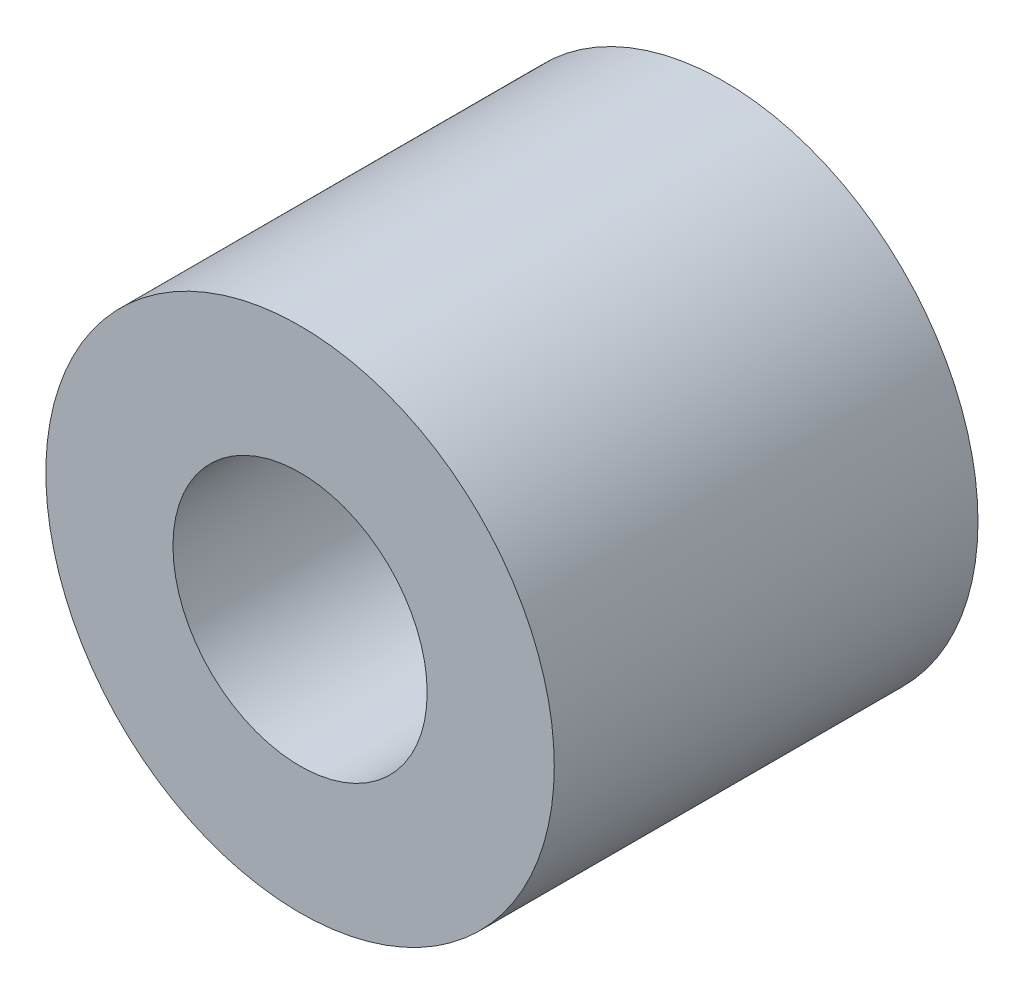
ISO-10303-21;
HEADER;
FILE_DESCRIPTION(('STEP AP214'),'2;1');
FILE_NAME('part.step','',(''),(''),'','','');
FILE_SCHEMA(('AUTOMOTIVE_DESIGN { 1 0 10303 214 1 1 1 1 }'));
ENDSEC;
DATA;
#1=APPLICATION_CONTEXT('core data for automotive mechanical design processes');
#2=APPLICATION_PROTOCOL_DEFINITION('international standard','automotive_design',2000,#1);
#3=PRODUCT_CONTEXT('',#1,'mechanical');
#4=PRODUCT('Part','Part','',(#3));
#5=PRODUCT_RELATED_PRODUCT_CATEGORY('part','',(#4));
#6=PRODUCT_DEFINITION_FORMATION('','',#4);
#7=PRODUCT_DEFINITION_CONTEXT('part definition',#1,'design');
#8=PRODUCT_DEFINITION('design','',#6,#7);
#9=PRODUCT_DEFINITION_SHAPE('','',#8);
#10=(LENGTH_UNIT() NAMED_UNIT(*) SI_UNIT(.MILLI.,.METRE.));
#11=(NAMED_UNIT(*) PLANE_ANGLE_UNIT() SI_UNIT($,.RADIAN.));
#12=(NAMED_UNIT(*) SI_UNIT($,.STERADIAN.) SOLID_ANGLE_UNIT());
#13=UNCERTAINTY_MEASURE_WITH_UNIT(LENGTH_MEASURE(1.E-05),#10,'distance_accuracy_value','');
#14=(GEOMETRIC_REPRESENTATION_CONTEXT(3) GLOBAL_UNCERTAINTY_ASSIGNED_CONTEXT((#13)) GLOBAL_UNIT_ASSIGNED_CONTEXT((#10,
#11,#12)) REPRESENTATION_CONTEXT('',''));
#15=CARTESIAN_POINT('',(0.,0.,0.));
#16=DIRECTION('',(0.,0.,1.));
#17=DIRECTION('',(1.,0.,0.));
#18=AXIS2_PLACEMENT_3D('',#15,#16,#17);
#19=CARTESIAN_POINT('',(0.,0.,0.));
#20=DIRECTION('',(0.,0.,1.));
#21=DIRECTION('',(1.,0.,0.));
#22=AXIS2_PLACEMENT_3D('',#19,#20,#21);
#23=CYLINDRICAL_SURFACE('',#22,3.);
#24=CARTESIAN_POINT('',(0.,0.,0.));
#25=DIRECTION('',(0.,0.,1.));
#26=DIRECTION('',(1.,0.,0.));
#27=AXIS2_PLACEMENT_3D('',#24,#25,#26);
#28=CIRCLE('',#27,3.);
#29=CARTESIAN_POINT('',(3.,0.,0.));
#30=VERTEX_POINT('',#29);
#31=EDGE_CURVE('E26',#30,#30,#28,.T.);
#32=ORIENTED_EDGE('',*,*,#31,.F.);
#33=EDGE_LOOP('',(#32));
#34=FACE_BOUND('',#33,.T.);
#35=CARTESIAN_POINT('',(0.,0.,10.));
#36=DIRECTION('',(0.,0.,1.));
#37=DIRECTION('',(1.,0.,0.));
#38=AXIS2_PLACEMENT_3D('',#35,#36,#37);
#39=CIRCLE('',#38,3.);
#40=CARTESIAN_POINT('',(3.,0.,10.));
#41=VERTEX_POINT('',#40);
#42=EDGE_CURVE('E17',#41,#41,#39,.T.);
#43=ORIENTED_EDGE('',*,*,#42,.T.);
#44=EDGE_LOOP('',(#43));
#45=FACE_BOUND('',#44,.T.);
#46=ADVANCED_FACE('F14',(#34,#45),#23,.F.);
#47=CARTESIAN_POINT('',(0.,0.,10.));
#48=DIRECTION('',(0.,0.,-1.));
#49=DIRECTION('',(-1.,0.,0.));
#50=AXIS2_PLACEMENT_3D('',#47,#48,#49);
#51=PLANE('',#50);
#52=ORIENTED_EDGE('',*,*,#42,.F.);
#53=EDGE_LOOP('',(#52));
#54=FACE_BOUND('',#53,.T.);
#55=CARTESIAN_POINT('',(0.,0.,10.));
#56=DIRECTION('',(0.,0.,1.));
#57=DIRECTION('',(1.,0.,0.));
#58=AXIS2_PLACEMENT_3D('',#55,#56,#57);
#59=CIRCLE('',#58,6.);
#60=CARTESIAN_POINT('',(6.,0.,10.));
#61=VERTEX_POINT('',#60);
#62=EDGE_CURVE('E21',#61,#61,#59,.F.);
#63=ORIENTED_EDGE('',*,*,#62,.F.);
#64=EDGE_LOOP('',(#63));
#65=FACE_BOUND('',#64,.T.);
#66=ADVANCED_FACE('F35',(#54,#65),#51,.F.);
#67=CARTESIAN_POINT('',(0.,0.,0.));
#68=DIRECTION('',(0.,0.,-1.));
#69=DIRECTION('',(-1.,0.,0.));
#70=AXIS2_PLACEMENT_3D('',#67,#68,#69);
#71=PLANE('',#70);
#72=ORIENTED_EDGE('',*,*,#31,.T.);
#73=EDGE_LOOP('',(#72));
#74=FACE_BOUND('',#73,.T.);
#75=CARTESIAN_POINT('',(0.,0.,0.));
#76=DIRECTION('',(0.,0.,1.));
#77=DIRECTION('',(1.,0.,0.));
#78=AXIS2_PLACEMENT_3D('',#75,#76,#77);
#79=CIRCLE('',#78,6.);
#80=CARTESIAN_POINT('',(6.,0.,0.));
#81=VERTEX_POINT('',#80);
#82=EDGE_CURVE('E10',#81,#81,#79,.T.);
#83=ORIENTED_EDGE('',*,*,#82,.F.);
#84=EDGE_LOOP('',(#83));
#85=FACE_BOUND('',#84,.T.);
#86=ADVANCED_FACE('F38',(#74,#85),#71,.T.);
#87=CARTESIAN_POINT('',(0.,0.,0.));
#88=DIRECTION('',(0.,0.,1.));
#89=DIRECTION('',(1.,0.,0.));
#90=AXIS2_PLACEMENT_3D('',#87,#88,#89);
#91=CYLINDRICAL_SURFACE('',#90,6.);
#92=ORIENTED_EDGE('',*,*,#82,.T.);
#93=EDGE_LOOP('',(#92));
#94=FACE_BOUND('',#93,.T.);
#95=ORIENTED_EDGE('',*,*,#62,.T.);
#96=EDGE_LOOP('',(#95));
#97=FACE_BOUND('',#96,.T.);
#98=ADVANCED_FACE('F41',(#94,#97),#91,.T.);
#99=CLOSED_SHELL('',(#46,#66,#86,#98));
#100=MANIFOLD_SOLID_BREP('B1',#99);
#101=ADVANCED_BREP_SHAPE_REPRESENTATION('',(#18,#100),#14);
#102=SHAPE_DEFINITION_REPRESENTATION(#9,#101);
ENDSEC;
END-ISO-10303-21;
